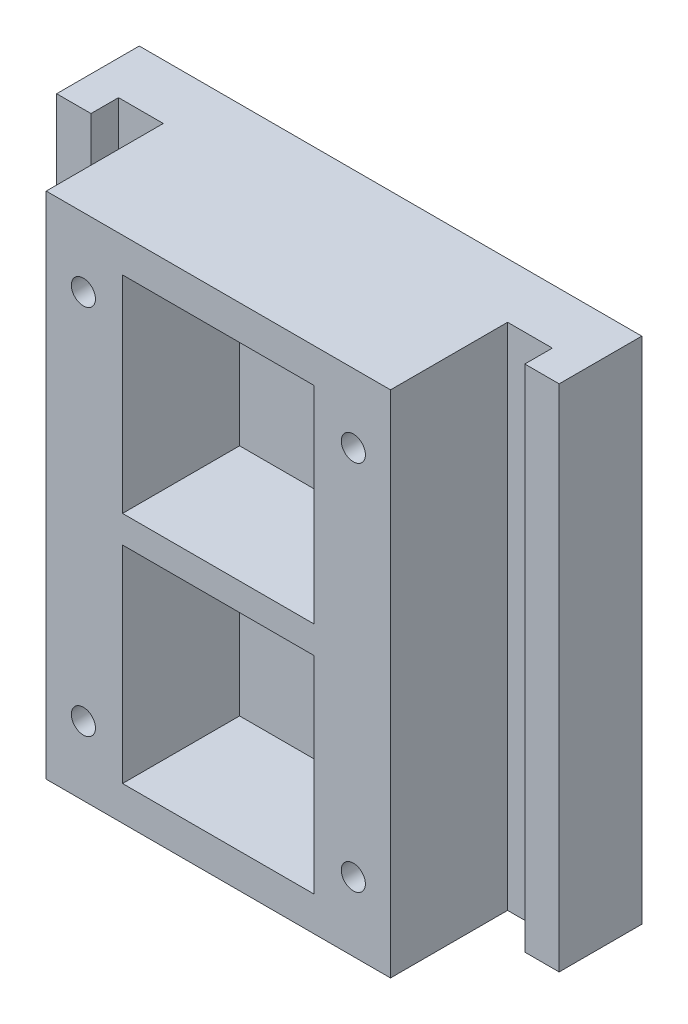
from build123d import *

# Parameters (mm, degrees)
SKETCH1_W           = 149.3
SKETCH1_H           = 73.97
BOSS_EXTRUDE1_DEPTH = 12
SKETCH2_W           = 6.5
SKETCH2_H           = 63.85
SKETCH2_W_2         = 27.840642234
SKETCH2_H_2         = 63.97
CUT_EXTRUDE1_DEPTH  = 4
SKETCH3_W           = 38.162240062
SKETCH3_H           = 80.739049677
CUT_EXTRUDE2_DEPTH  = 20
SKETCH6_W           = 6.5
SKETCH6_H           = 4.87
SKETCH6_H_2         = 5.25
CUT_EXTRUDE3_DEPTH  = 4
SKETCH7_W           = 50
SKETCH7_H           = 73.97
SKETCH7_W_2         = 27.840642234
SKETCH7_H_2         = 63.97
BOSS_EXTRUDE2_DEPTH = 13
CUT_EXTRUDE5_START  = -25
SKETCH8_R           = 3
CUT_EXTRUDE5_DEPTH  = 15
SKETCH9_R           = 1.75
CUT_EXTRUDE6_DEPTH  = 136.824013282
SKETCH11_W          = 27.840642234
SKETCH11_H          = 3.97
BOSS_EXTRUDE3_DEPTH = 17


with BuildPart() as part:
    # Sketch1 → Boss-Extrude1 (new body)
    with BuildSketch(Plane.XY):
        with Locations((74.65, 36.985)):
            Rectangle(SKETCH1_W, SKETCH1_H)
    extrude(amount=BOSS_EXTRUDE1_DEPTH)

    # Sketch2 → Cut-Extrude1 (cut)
    with BuildSketch(Plane.XY.offset(12)):
        with Locations((46.4, 36.795)):
            Rectangle(SKETCH2_W, SKETCH2_H)
        with Locations((102.9, 36.795)):
            Rectangle(SKETCH2_W, SKETCH2_H)
        with Locations((74.65, 36.985)):
            Rectangle(SKETCH2_W_2, SKETCH2_H_2)
    extrude(amount=-CUT_EXTRUDE1_DEPTH, mode=Mode.SUBTRACT)

    # Sketch3 → Cut-Extrude2 (cut)
    with BuildSketch(Plane.XY.offset(12)):
        with Locations((19.081120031, 40.369524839)):
            Rectangle(SKETCH3_W, SKETCH3_H)
        with Locations((130.218879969, 40.369524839)):
            Rectangle(SKETCH3_W, SKETCH3_H)
    extrude(amount=-CUT_EXTRUDE2_DEPTH, mode=Mode.SUBTRACT)

    # Sketch6 → Cut-Extrude3 (cut)
    with BuildSketch(Plane.XY.offset(12)):
        with Locations((102.9, 2.435)):
            Rectangle(SKETCH6_W, SKETCH6_H)
        with Locations((46.4, 2.435)):
            Rectangle(SKETCH6_W, SKETCH6_H)
        with Locations((46.4, 71.345)):
            Rectangle(SKETCH6_W, SKETCH6_H_2)
        with Locations((102.9, 71.345)):
            Rectangle(SKETCH6_W, SKETCH6_H_2)
    extrude(amount=-CUT_EXTRUDE3_DEPTH, mode=Mode.SUBTRACT)

    # Sketch7 → Boss-Extrude2 (add)
    with BuildSketch(Plane.XY.offset(12)):
        with Locations((74.65, 36.985)):
            Rectangle(SKETCH7_W, SKETCH7_H)
        with Locations((74.65, 36.985)):
            Rectangle(SKETCH7_W_2, SKETCH7_H_2, mode=Mode.SUBTRACT)
    extrude(amount=BOSS_EXTRUDE2_DEPTH)

    # Sketch8 → Cut-Extrude5 (cut)
    with BuildSketch(Plane.XY.offset(25).offset(CUT_EXTRUDE5_START)):
        with Locations(Location((94.251072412, 63.97, 0), (0, 0, 180))):
            Circle(SKETCH8_R)
        with Locations(Location((94.251072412, 10, 0), (0, 0, 180))):
            Circle(SKETCH8_R)
    cut_extrude5 = extrude(amount=CUT_EXTRUDE5_DEPTH, mode=Mode.SUBTRACT)

    # Sketch9 → Cut-Extrude6 (cut, through all)
    with BuildSketch(Plane.XY.offset(25)):
        with Locations((94.251072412, 10)):
            Circle(SKETCH9_R)
        with Locations((94.251072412, 63.97)):
            Circle(SKETCH9_R)
    cut_extrude6 = extrude(amount=-CUT_EXTRUDE6_DEPTH, mode=Mode.SUBTRACT)

    # Mirror1: Cut-Extrude5, Cut-Extrude6 across plane
    add(cut_extrude5.mirror(Plane.ZY.offset(-74.65)), mode=Mode.SUBTRACT)
    add(cut_extrude6.mirror(Plane.ZY.offset(-74.65)), mode=Mode.SUBTRACT)

    # Sketch11 → Boss-Extrude3 (add)
    with BuildSketch(Plane.XY.offset(8)):
        with Locations((74.65, 36.985)):
            Rectangle(SKETCH11_W, SKETCH11_H)
    extrude(amount=BOSS_EXTRUDE3_DEPTH)


solid = part.part
